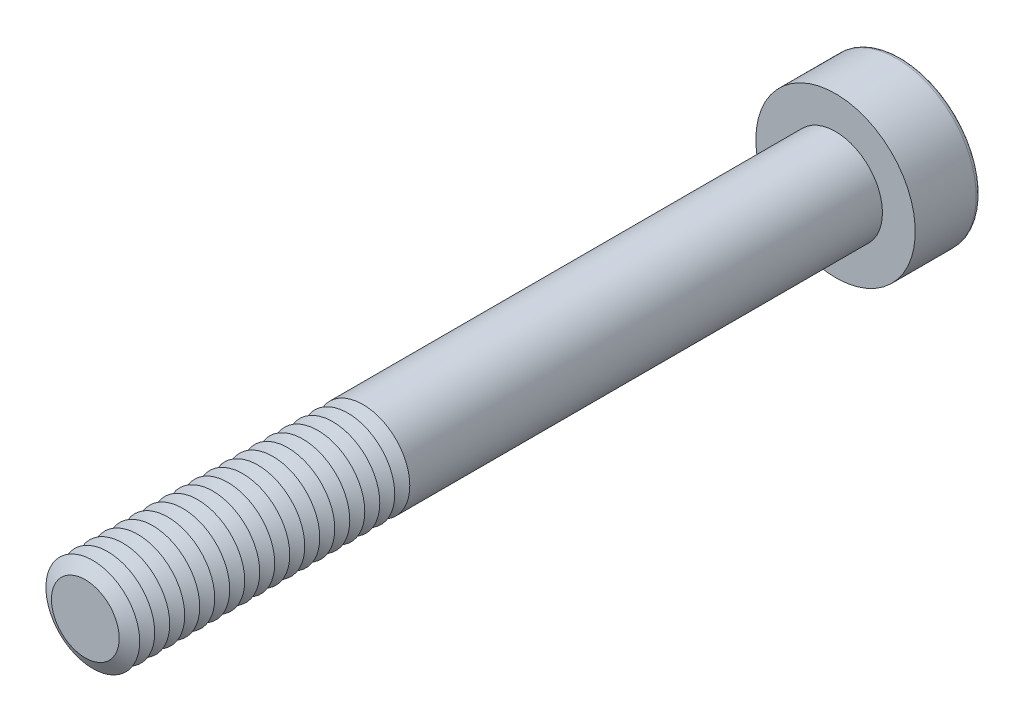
from build123d import *

# Parameters (mm, degrees)
SKETCH1_R           = 2.5
BOSS_EXTRUDE1_DEPTH = 40
SKETCH2_R           = 4.25
BOSS_EXTRUDE2_DEPTH = 3.5
CUT_EXTRUDE1_DEPTH  = 2.25
FILLET1_R           = 0.25
LPATTERN1_COUNT     = 19
LPATTERN1_PITCH     = 0.8


with BuildPart() as part:
    # Sketch1 → Boss-Extrude1 (new body)
    with BuildSketch(Plane.XY):
        Circle(SKETCH1_R)
    extrude(amount=BOSS_EXTRUDE1_DEPTH)

    # Sketch2 → Boss-Extrude2 (add)
    with BuildSketch(Plane(origin=(0, 0, 0), x_dir=(-1, 0, 0), z_dir=(0, 0, -1))):
        Circle(SKETCH2_R)
    extrude(amount=BOSS_EXTRUDE2_DEPTH)

    # Sketch3 → Cut-Extrude1 (cut)
    with BuildSketch(Plane(origin=(0, 0, -3.5), x_dir=(-1, 0, 0), z_dir=(0, 0, -1))):
        Polygon((-0.866025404, 1.5), (-1.732050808, 0), (-0.866025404, -1.5), (0.866025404, -1.5), (1.732050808, 0), (0.866025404, 1.5), align=None)
    extrude(amount=-CUT_EXTRUDE1_DEPTH, mode=Mode.SUBTRACT)

    # Fillet1
    fillet1_edges = [part.edges().sort_by_distance(p)[0] for p in [
        (4.25, 0, -3.5),
    ]]
    fillet(fillet1_edges, radius=FILLET1_R)

    # Cut-Extrude2 cone 1 section (on through the dimple's axis) → Cut-Extrude2 (revolve, cut)
    with BuildSketch(Plane(origin=(0, 0, -1.25), x_dir=(0, 1, 0), z_dir=(1, 0, 0))):
        Polygon((0, 0), (1.5, 0), (0, 0.866025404), align=None)
    revolve(axis=Axis((0, 0, -1.25), (0, 0, 1)), mode=Mode.SUBTRACT)

    # Cut-Extrude3 cone 1 section (on through the dimple's axis) → Cut-Extrude3 (revolve, cut)
    with BuildSketch(Plane(origin=(0, 0, -3.5), x_dir=(0, 1, 0), z_dir=(1, 0, 0))):
        Polygon((0, 0), (1.732050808, 0), (0, 0.464101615), align=None)
    revolve(axis=Axis((0, 0, -3.5), (0, 0, 1)), mode=Mode.SUBTRACT)

    # Sketch7 → Cut-Revolve1 (revolve, cut)
    with BuildSketch(Plane(origin=(0, 0, 0), x_dir=(0, 0, -1), z_dir=(1, 0, 0)), mode=Mode.PRIVATE) as cut_revolve1_sk:
        Polygon((-40, 1.807179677), (-39.6, 2.5), (-40.4, 2.5), align=None)
    cut_revolve1 = revolve(cut_revolve1_sk.sketch.rotate(Axis((0, 0, 40), (0, 0, -1)), 90), axis=Axis((0, 0, 40), (0, 0, -1)), mode=Mode.SUBTRACT)

    # LPattern1: Cut-Revolve1 ×19
    with Locations(*[(0, 0, -i * LPATTERN1_PITCH) for i in range(1, LPATTERN1_COUNT)]):
        add(cut_revolve1, mode=Mode.SUBTRACT)


solid = part.part
